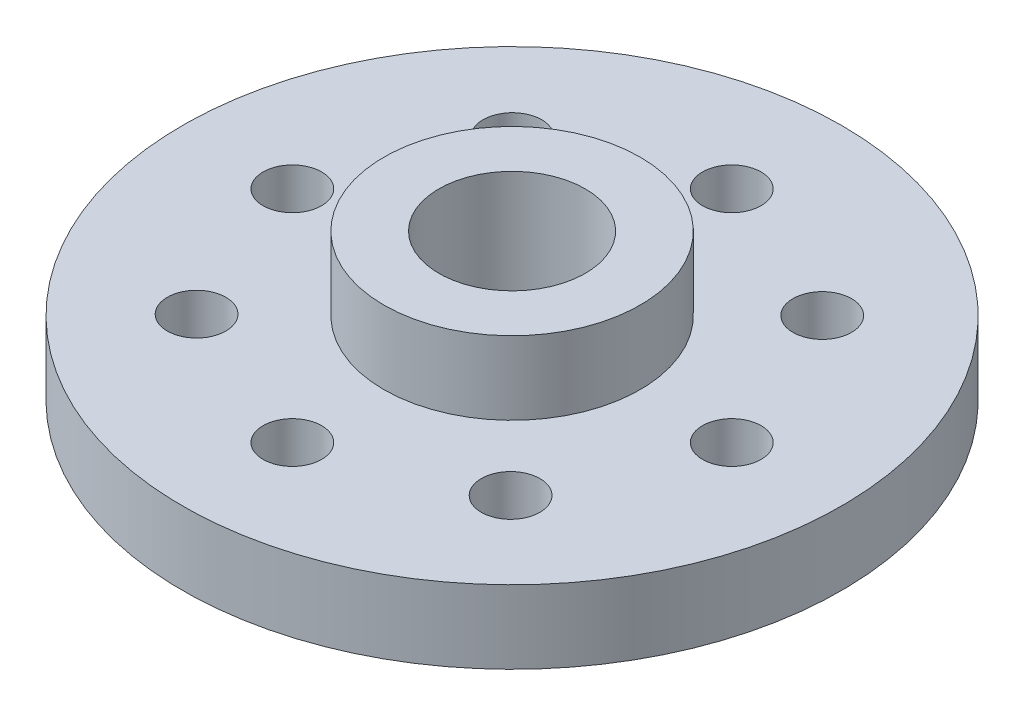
from build123d import *

# Parameters (mm, degrees)
TROU_POUR_TARAUDAGE_POUR_TROU_TARAUD_M2_D     = 1.6
TROU_POUR_TARAUDAGE_POUR_TROU_TARAUD_M2_DEPTH = 6
TROU_POUR_TARAUDAGE_POUR_TROU_TARAUD_M2_TIP   = 0.480688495


with BuildPart() as part:
    # Esquisse1 → R_volution1 (revolve)
    with BuildSketch(Plane.XY, mode=Mode.PRIVATE) as r_volution1_sk:
        Polygon((-1, 0), (-9, 0), (-9, 2), (-3.5, 2), (-3.5, 4), (-2, 4), (-2, 0.5), (-1, 0.5), align=None)
    revolve(r_volution1_sk.sketch.rotate(Axis((0, 0, 0), (0, 1, 0)), 270), axis=Axis((0, 0, 0), (0, 1, 0)))

    # Trou pour taraudage pour trou taraud_ M2
    with Locations(Plane(origin=(0, 0, 0), x_dir=(-1, 0, 0), z_dir=(0, -1, 0))):
        with Locations((0, -6), (6, 0), (-6, 0), (0, 6), (-4.231232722, 4.239276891), (-4.231232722, -4.271453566), (4.343851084, -4.271453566), (4.231232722, 4.239276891)):
            Hole(TROU_POUR_TARAUDAGE_POUR_TROU_TARAUD_M2_D / 2, depth=TROU_POUR_TARAUDAGE_POUR_TROU_TARAUD_M2_DEPTH)
            with Locations((0, 0, -(TROU_POUR_TARAUDAGE_POUR_TROU_TARAUD_M2_DEPTH + TROU_POUR_TARAUDAGE_POUR_TROU_TARAUD_M2_TIP / 2))):  # 118° drill point
                Cone(0, TROU_POUR_TARAUDAGE_POUR_TROU_TARAUD_M2_D / 2, TROU_POUR_TARAUDAGE_POUR_TROU_TARAUD_M2_TIP, mode=Mode.SUBTRACT)


solid = part.part
